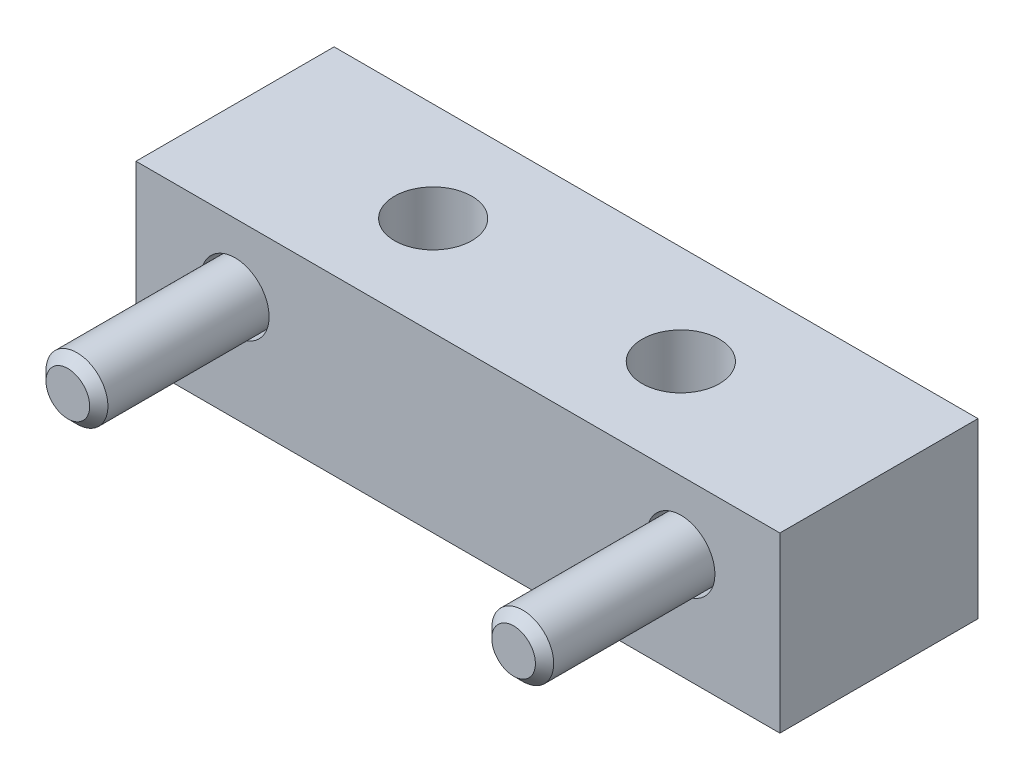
ISO-10303-21;
HEADER;
FILE_DESCRIPTION(('STEP AP214'),'2;1');
FILE_NAME('part.step','',(''),(''),'','','');
FILE_SCHEMA(('AUTOMOTIVE_DESIGN { 1 0 10303 214 1 1 1 1 }'));
ENDSEC;
DATA;
#1=APPLICATION_CONTEXT('core data for automotive mechanical design processes');
#2=APPLICATION_PROTOCOL_DEFINITION('international standard','automotive_design',2000,#1);
#3=PRODUCT_CONTEXT('',#1,'mechanical');
#4=PRODUCT('Part','Part','',(#3));
#5=PRODUCT_RELATED_PRODUCT_CATEGORY('part','',(#4));
#6=PRODUCT_DEFINITION_FORMATION('','',#4);
#7=PRODUCT_DEFINITION_CONTEXT('part definition',#1,'design');
#8=PRODUCT_DEFINITION('design','',#6,#7);
#9=PRODUCT_DEFINITION_SHAPE('','',#8);
#10=(LENGTH_UNIT() NAMED_UNIT(*) SI_UNIT(.MILLI.,.METRE.));
#11=(NAMED_UNIT(*) PLANE_ANGLE_UNIT() SI_UNIT($,.RADIAN.));
#12=(NAMED_UNIT(*) SI_UNIT($,.STERADIAN.) SOLID_ANGLE_UNIT());
#13=UNCERTAINTY_MEASURE_WITH_UNIT(LENGTH_MEASURE(1.E-05),#10,'distance_accuracy_value','');
#14=(GEOMETRIC_REPRESENTATION_CONTEXT(3) GLOBAL_UNCERTAINTY_ASSIGNED_CONTEXT((#13)) GLOBAL_UNIT_ASSIGNED_CONTEXT((#10,
#11,#12)) REPRESENTATION_CONTEXT('',''));
#15=CARTESIAN_POINT('',(0.,0.,0.));
#16=DIRECTION('',(0.,0.,1.));
#17=DIRECTION('',(1.,0.,0.));
#18=AXIS2_PLACEMENT_3D('',#15,#16,#17);
#19=CARTESIAN_POINT('',(34.074261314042,3.17499999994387,-20.7645));
#20=DIRECTION('',(0.,0.,1.));
#21=DIRECTION('',(0.5,0.866025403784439,0.));
#22=AXIS2_PLACEMENT_3D('',#19,#20,#21);
#23=PLANE('',#22);
#24=DIRECTION('',(-0.5,-0.866025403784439,0.));
#25=VECTOR('',#24,1.);
#26=CARTESIAN_POINT('',(32.2411742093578,-6.86032448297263E-11,-20.7645));
#27=LINE('',#26,#25);
#28=CARTESIAN_POINT('',(32.2411742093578,-6.86032448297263E-11,-20.7645));
#29=VERTEX_POINT('',#28);
#30=CARTESIAN_POINT('',(30.4080871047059,-3.17500000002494,-20.7645));
#31=VERTEX_POINT('',#30);
#32=EDGE_CURVE('E284',#29,#31,#27,.T.);
#33=ORIENTED_EDGE('',*,*,#32,.T.);
#34=DIRECTION('',(-1.,0.,0.));
#35=VECTOR('',#34,1.);
#36=CARTESIAN_POINT('',(30.4080871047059,-3.17500000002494,-20.7645));
#37=LINE('',#36,#35);
#38=CARTESIAN_POINT('',(26.7419128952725,-3.17500000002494,-20.7645));
#39=VERTEX_POINT('',#38);
#40=EDGE_CURVE('E287',#31,#39,#37,.T.);
#41=ORIENTED_EDGE('',*,*,#40,.T.);
#42=DIRECTION('',(-0.5,0.866025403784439,0.));
#43=VECTOR('',#42,1.);
#44=CARTESIAN_POINT('',(26.7419128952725,-3.17500000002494,-20.7645));
#45=LINE('',#44,#43);
#46=CARTESIAN_POINT('',(24.9088257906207,-6.86036785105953E-11,-20.7645));
#47=VERTEX_POINT('',#46);
#48=EDGE_CURVE('E290',#39,#47,#45,.T.);
#49=ORIENTED_EDGE('',*,*,#48,.T.);
#50=DIRECTION('',(0.5,0.866025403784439,0.));
#51=VECTOR('',#50,1.);
#52=CARTESIAN_POINT('',(24.9088257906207,-6.86036785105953E-11,-20.7645));
#53=LINE('',#52,#51);
#54=CARTESIAN_POINT('',(26.741912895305,3.17499999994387,-20.7645));
#55=VERTEX_POINT('',#54);
#56=EDGE_CURVE('E293',#47,#55,#53,.T.);
#57=ORIENTED_EDGE('',*,*,#56,.T.);
#58=DIRECTION('',(1.,0.,0.));
#59=VECTOR('',#58,1.);
#60=CARTESIAN_POINT('',(26.741912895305,3.17499999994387,-20.7645));
#61=LINE('',#60,#59);
#62=CARTESIAN_POINT('',(30.4080871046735,3.17499999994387,-20.7645));
#63=VERTEX_POINT('',#62);
#64=EDGE_CURVE('E296',#55,#63,#61,.T.);
#65=ORIENTED_EDGE('',*,*,#64,.T.);
#66=DIRECTION('',(0.5,-0.866025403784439,0.));
#67=VECTOR('',#66,1.);
#68=CARTESIAN_POINT('',(30.4080871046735,3.17499999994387,-20.7645));
#69=LINE('',#68,#67);
#70=EDGE_CURVE('E299',#63,#29,#69,.T.);
#71=ORIENTED_EDGE('',*,*,#70,.T.);
#72=EDGE_LOOP('',(#33,#41,#49,#57,#65,#71));
#73=FACE_BOUND('',#72,.T.);
#74=ADVANCED_FACE('F14',(#73),#23,.F.);
#75=CARTESIAN_POINT('',(30.4080871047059,-3.17500000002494,-20.7645));
#76=DIRECTION('',(0.,-1.,0.));
#77=DIRECTION('',(-1.,0.,0.));
#78=AXIS2_PLACEMENT_3D('',#75,#76,#77);
#79=PLANE('',#78);
#80=DIRECTION('',(-1.,0.,0.));
#81=VECTOR('',#80,1.);
#82=CARTESIAN_POINT('',(30.4080871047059,-3.17500000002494,-24.5999));
#83=LINE('',#82,#81);
#84=CARTESIAN_POINT('',(30.4080871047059,-3.17500000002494,-24.5999));
#85=VERTEX_POINT('',#84);
#86=CARTESIAN_POINT('',(26.7419128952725,-3.17500000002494,-24.5999));
#87=VERTEX_POINT('',#86);
#88=EDGE_CURVE('E270',#85,#87,#83,.T.);
#89=ORIENTED_EDGE('',*,*,#88,.T.);
#90=DIRECTION('',(0.,0.,-1.));
#91=VECTOR('',#90,1.);
#92=CARTESIAN_POINT('',(26.7419128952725,-3.17500000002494,-20.7645));
#93=LINE('',#92,#91);
#94=EDGE_CURVE('E311',#39,#87,#93,.T.);
#95=ORIENTED_EDGE('',*,*,#94,.F.);
#96=ORIENTED_EDGE('',*,*,#40,.F.);
#97=DIRECTION('',(0.,0.,-1.));
#98=VECTOR('',#97,1.);
#99=CARTESIAN_POINT('',(30.4080871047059,-3.17500000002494,-20.7645));
#100=LINE('',#99,#98);
#101=EDGE_CURVE('E302',#31,#85,#100,.T.);
#102=ORIENTED_EDGE('',*,*,#101,.T.);
#103=EDGE_LOOP('',(#89,#95,#96,#102));
#104=FACE_BOUND('',#103,.T.);
#105=ADVANCED_FACE('F525',(#104),#79,.F.);
#106=CARTESIAN_POINT('',(26.7419128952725,-3.17500000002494,-20.7645));
#107=DIRECTION('',(-0.866025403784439,-0.5,0.));
#108=DIRECTION('',(-0.5,0.866025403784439,0.));
#109=AXIS2_PLACEMENT_3D('',#106,#107,#108);
#110=PLANE('',#109);
#111=DIRECTION('',(-0.5,0.866025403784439,0.));
#112=VECTOR('',#111,1.);
#113=CARTESIAN_POINT('',(26.7419128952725,-3.17500000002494,-24.5999));
#114=LINE('',#113,#112);
#115=CARTESIAN_POINT('',(24.9088257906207,-6.86036785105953E-11,-24.5999));
#116=VERTEX_POINT('',#115);
#117=EDGE_CURVE('E273',#87,#116,#114,.T.);
#118=ORIENTED_EDGE('',*,*,#117,.T.);
#119=DIRECTION('',(0.,0.,-1.));
#120=VECTOR('',#119,1.);
#121=CARTESIAN_POINT('',(24.9088257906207,-6.86036785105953E-11,-20.7645));
#122=LINE('',#121,#120);
#123=EDGE_CURVE('E309',#47,#116,#122,.T.);
#124=ORIENTED_EDGE('',*,*,#123,.F.);
#125=ORIENTED_EDGE('',*,*,#48,.F.);
#126=ORIENTED_EDGE('',*,*,#94,.T.);
#127=EDGE_LOOP('',(#118,#124,#125,#126));
#128=FACE_BOUND('',#127,.T.);
#129=ADVANCED_FACE('F537',(#128),#110,.F.);
#130=CARTESIAN_POINT('',(24.9088257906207,-6.86036785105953E-11,-20.7645));
#131=DIRECTION('',(-0.866025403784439,0.5,0.));
#132=DIRECTION('',(0.5,0.866025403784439,0.));
#133=AXIS2_PLACEMENT_3D('',#130,#131,#132);
#134=PLANE('',#133);
#135=DIRECTION('',(0.5,0.866025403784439,0.));
#136=VECTOR('',#135,1.);
#137=CARTESIAN_POINT('',(24.9088257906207,-6.86036785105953E-11,-24.5999));
#138=LINE('',#137,#136);
#139=CARTESIAN_POINT('',(26.741912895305,3.17499999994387,-24.5999));
#140=VERTEX_POINT('',#139);
#141=EDGE_CURVE('E276',#116,#140,#138,.T.);
#142=ORIENTED_EDGE('',*,*,#141,.T.);
#143=DIRECTION('',(0.,0.,-1.));
#144=VECTOR('',#143,1.);
#145=CARTESIAN_POINT('',(26.741912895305,3.17499999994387,-20.7645));
#146=LINE('',#145,#144);
#147=EDGE_CURVE('E307',#55,#140,#146,.T.);
#148=ORIENTED_EDGE('',*,*,#147,.F.);
#149=ORIENTED_EDGE('',*,*,#56,.F.);
#150=ORIENTED_EDGE('',*,*,#123,.T.);
#151=EDGE_LOOP('',(#142,#148,#149,#150));
#152=FACE_BOUND('',#151,.T.);
#153=ADVANCED_FACE('F533',(#152),#134,.F.);
#154=CARTESIAN_POINT('',(26.741912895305,3.17499999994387,-20.7645));
#155=DIRECTION('',(0.,1.,0.));
#156=DIRECTION('',(1.,0.,0.));
#157=AXIS2_PLACEMENT_3D('',#154,#155,#156);
#158=PLANE('',#157);
#159=DIRECTION('',(1.,0.,0.));
#160=VECTOR('',#159,1.);
#161=CARTESIAN_POINT('',(26.741912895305,3.17499999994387,-24.5999));
#162=LINE('',#161,#160);
#163=CARTESIAN_POINT('',(30.4080871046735,3.17499999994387,-24.5999));
#164=VERTEX_POINT('',#163);
#165=EDGE_CURVE('E279',#140,#164,#162,.T.);
#166=ORIENTED_EDGE('',*,*,#165,.T.);
#167=DIRECTION('',(0.,0.,-1.));
#168=VECTOR('',#167,1.);
#169=CARTESIAN_POINT('',(30.4080871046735,3.17499999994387,-20.7645));
#170=LINE('',#169,#168);
#171=EDGE_CURVE('E305',#63,#164,#170,.T.);
#172=ORIENTED_EDGE('',*,*,#171,.F.);
#173=ORIENTED_EDGE('',*,*,#64,.F.);
#174=ORIENTED_EDGE('',*,*,#147,.T.);
#175=EDGE_LOOP('',(#166,#172,#173,#174));
#176=FACE_BOUND('',#175,.T.);
#177=ADVANCED_FACE('F530',(#176),#158,.F.);
#178=CARTESIAN_POINT('',(30.4080871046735,3.17499999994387,-20.7645));
#179=DIRECTION('',(0.866025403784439,0.5,0.));
#180=DIRECTION('',(0.5,-0.866025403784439,0.));
#181=AXIS2_PLACEMENT_3D('',#178,#179,#180);
#182=PLANE('',#181);
#183=DIRECTION('',(0.5,-0.866025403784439,0.));
#184=VECTOR('',#183,1.);
#185=CARTESIAN_POINT('',(30.4080871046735,3.17499999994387,-24.5999));
#186=LINE('',#185,#184);
#187=CARTESIAN_POINT('',(32.2411742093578,-6.86032448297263E-11,-24.5999));
#188=VERTEX_POINT('',#187);
#189=EDGE_CURVE('E282',#164,#188,#186,.T.);
#190=ORIENTED_EDGE('',*,*,#189,.T.);
#191=DIRECTION('',(0.,0.,-1.));
#192=VECTOR('',#191,1.);
#193=CARTESIAN_POINT('',(32.2411742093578,-6.86032448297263E-11,-20.7645));
#194=LINE('',#193,#192);
#195=EDGE_CURVE('E36',#29,#188,#194,.T.);
#196=ORIENTED_EDGE('',*,*,#195,.F.);
#197=ORIENTED_EDGE('',*,*,#70,.F.);
#198=ORIENTED_EDGE('',*,*,#171,.T.);
#199=EDGE_LOOP('',(#190,#196,#197,#198));
#200=FACE_BOUND('',#199,.T.);
#201=ADVANCED_FACE('F527',(#200),#182,.F.);
#202=CARTESIAN_POINT('',(32.2411742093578,-6.86032448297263E-11,-20.7645));
#203=DIRECTION('',(0.866025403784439,-0.5,0.));
#204=DIRECTION('',(-0.5,-0.866025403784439,0.));
#205=AXIS2_PLACEMENT_3D('',#202,#203,#204);
#206=PLANE('',#205);
#207=DIRECTION('',(-0.5,-0.866025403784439,0.));
#208=VECTOR('',#207,1.);
#209=CARTESIAN_POINT('',(32.2411742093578,-6.86032448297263E-11,-24.5999));
#210=LINE('',#209,#208);
#211=EDGE_CURVE('E29',#188,#85,#210,.T.);
#212=ORIENTED_EDGE('',*,*,#211,.T.);
#213=ORIENTED_EDGE('',*,*,#101,.F.);
#214=ORIENTED_EDGE('',*,*,#32,.F.);
#215=ORIENTED_EDGE('',*,*,#195,.T.);
#216=EDGE_LOOP('',(#212,#213,#214,#215));
#217=FACE_BOUND('',#216,.T.);
#218=ADVANCED_FACE('F459',(#217),#206,.F.);
#219=CARTESIAN_POINT('',(23.934503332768,2.679192,-24.5999));
#220=DIRECTION('',(0.,0.,-1.));
#221=DIRECTION('',(-0.5,-0.866025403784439,0.));
#222=AXIS2_PLACEMENT_3D('',#219,#220,#221);
#223=PLANE('',#222);
#224=ORIENTED_EDGE('',*,*,#211,.F.);
#225=ORIENTED_EDGE('',*,*,#189,.F.);
#226=ORIENTED_EDGE('',*,*,#165,.F.);
#227=ORIENTED_EDGE('',*,*,#141,.F.);
#228=ORIENTED_EDGE('',*,*,#117,.F.);
#229=ORIENTED_EDGE('',*,*,#88,.F.);
#230=EDGE_LOOP('',(#224,#225,#226,#227,#228,#229));
#231=FACE_BOUND('',#230,.T.);
#232=CARTESIAN_POINT('',(28.575,0.,-24.5999));
#233=DIRECTION('',(0.,0.,1.));
#234=DIRECTION('',(0.5,0.866025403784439,0.));
#235=AXIS2_PLACEMENT_3D('',#232,#233,#234);
#236=CIRCLE('',#235,5.358384);
#237=CARTESIAN_POINT('',(31.254192,4.64049666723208,-24.5999));
#238=VERTEX_POINT('',#237);
#239=EDGE_CURVE('E319',#238,#238,#236,.T.);
#240=ORIENTED_EDGE('',*,*,#239,.F.);
#241=EDGE_LOOP('',(#240));
#242=FACE_BOUND('',#241,.T.);
#243=ADVANCED_FACE('F465',(#231,#242),#223,.T.);
#244=CARTESIAN_POINT('',(28.575,0.,-24.004524));
#245=DIRECTION('',(0.,0.,1.));
#246=DIRECTION('',(0.5,0.866025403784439,0.));
#247=AXIS2_PLACEMENT_3D('',#244,#245,#246);
#248=CONICAL_SURFACE('',#247,5.95376,0.785398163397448);
#249=ORIENTED_EDGE('',*,*,#239,.T.);
#250=EDGE_LOOP('',(#249));
#251=FACE_BOUND('',#250,.T.);
#252=CARTESIAN_POINT('',(28.575,0.,-24.004524));
#253=DIRECTION('',(0.,0.,1.));
#254=DIRECTION('',(0.5,0.866025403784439,0.));
#255=AXIS2_PLACEMENT_3D('',#252,#253,#254);
#256=CIRCLE('',#255,5.95376);
#257=CARTESIAN_POINT('',(31.55188,5.15610740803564,-24.004524));
#258=VERTEX_POINT('',#257);
#259=EDGE_CURVE('E322',#258,#258,#256,.T.);
#260=ORIENTED_EDGE('',*,*,#259,.F.);
#261=EDGE_LOOP('',(#260));
#262=FACE_BOUND('',#261,.T.);
#263=ADVANCED_FACE('F468',(#251,#262),#248,.T.);
#264=CARTESIAN_POINT('',(28.575,0.,-16.6624));
#265=DIRECTION('',(0.,0.,1.));
#266=DIRECTION('',(0.5,0.866025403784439,0.));
#267=AXIS2_PLACEMENT_3D('',#264,#265,#266);
#268=CYLINDRICAL_SURFACE('',#267,5.95376);
#269=ORIENTED_EDGE('',*,*,#259,.T.);
#270=EDGE_LOOP('',(#269));
#271=FACE_BOUND('',#270,.T.);
#272=CARTESIAN_POINT('',(28.575,0.,-16.6624));
#273=DIRECTION('',(0.,0.,1.));
#274=DIRECTION('',(0.5,0.866025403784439,0.));
#275=AXIS2_PLACEMENT_3D('',#272,#273,#274);
#276=CIRCLE('',#275,5.95376);
#277=CARTESIAN_POINT('',(31.55188,5.15610740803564,-16.6624));
#278=VERTEX_POINT('',#277);
#279=EDGE_CURVE('E325',#278,#278,#276,.T.);
#280=ORIENTED_EDGE('',*,*,#279,.F.);
#281=EDGE_LOOP('',(#280));
#282=FACE_BOUND('',#281,.T.);
#283=ADVANCED_FACE('F336',(#271,#282),#268,.T.);
#284=CARTESIAN_POINT('',(28.575,0.,-16.6624));
#285=DIRECTION('',(0.,0.,1.));
#286=DIRECTION('',(0.5,0.866025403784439,0.));
#287=AXIS2_PLACEMENT_3D('',#284,#285,#286);
#288=PLANE('',#287);
#289=CARTESIAN_POINT('',(28.575,0.,-16.6624));
#290=DIRECTION('',(0.,0.,1.));
#291=DIRECTION('',(0.5,0.866025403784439,0.));
#292=AXIS2_PLACEMENT_3D('',#289,#290,#291);
#293=CIRCLE('',#292,3.96875);
#294=CARTESIAN_POINT('',(30.559375,3.43703832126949,-16.6624));
#295=VERTEX_POINT('',#294);
#296=EDGE_CURVE('E22',#295,#295,#293,.T.);
#297=ORIENTED_EDGE('',*,*,#296,.F.);
#298=EDGE_LOOP('',(#297));
#299=FACE_BOUND('',#298,.T.);
#300=CARTESIAN_POINT('',(28.575,0.,-16.6624));
#301=DIRECTION('',(0.,0.,1.));
#302=DIRECTION('',(1.,0.,0.));
#303=AXIS2_PLACEMENT_3D('',#300,#301,#302);
#304=CIRCLE('',#303,4.3688);
#305=CARTESIAN_POINT('',(32.9438,0.,-16.6624));
#306=VERTEX_POINT('',#305);
#307=EDGE_CURVE('E9',#306,#306,#304,.T.);
#308=ORIENTED_EDGE('',*,*,#307,.T.);
#309=EDGE_LOOP('',(#308));
#310=FACE_BOUND('',#309,.T.);
#311=ADVANCED_FACE('F16',(#299,#310),#288,.T.);
#312=CARTESIAN_POINT('',(28.575,0.,21.4376));
#313=DIRECTION('',(0.,0.,1.));
#314=DIRECTION('',(0.5,0.866025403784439,0.));
#315=AXIS2_PLACEMENT_3D('',#312,#313,#314);
#316=PLANE('',#315);
#317=CARTESIAN_POINT('',(28.575,0.,21.4376));
#318=DIRECTION('',(0.,0.,1.));
#319=DIRECTION('',(0.5,0.866025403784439,0.));
#320=AXIS2_PLACEMENT_3D('',#317,#318,#319);
#321=CIRCLE('',#320,2.79768935);
#322=CARTESIAN_POINT('',(29.973844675,2.42287004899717,21.4376));
#323=VERTEX_POINT('',#322);
#324=EDGE_CURVE('E316',#323,#323,#321,.T.);
#325=ORIENTED_EDGE('',*,*,#324,.T.);
#326=EDGE_LOOP('',(#325));
#327=FACE_BOUND('',#326,.T.);
#328=ADVANCED_FACE('F335',(#327),#316,.T.);
#329=CARTESIAN_POINT('',(28.575,0.,21.4376));
#330=DIRECTION('',(0.,0.,-1.));
#331=DIRECTION('',(-0.5,-0.866025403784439,0.));
#332=AXIS2_PLACEMENT_3D('',#329,#330,#331);
#333=CONICAL_SURFACE('',#332,2.79768935,0.785398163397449);
#334=CARTESIAN_POINT('',(28.575,0.,20.26653935));
#335=DIRECTION('',(0.,0.,1.));
#336=DIRECTION('',(0.5,0.866025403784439,0.));
#337=AXIS2_PLACEMENT_3D('',#334,#335,#336);
#338=CIRCLE('',#337,3.96875);
#339=CARTESIAN_POINT('',(30.559375,3.43703832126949,20.26653935));
#340=VERTEX_POINT('',#339);
#341=EDGE_CURVE('E304',#340,#340,#338,.T.);
#342=ORIENTED_EDGE('',*,*,#341,.T.);
#343=EDGE_LOOP('',(#342));
#344=FACE_BOUND('',#343,.T.);
#345=ORIENTED_EDGE('',*,*,#324,.F.);
#346=EDGE_LOOP('',(#345));
#347=FACE_BOUND('',#346,.T.);
#348=ADVANCED_FACE('F446',(#344,#347),#333,.T.);
#349=CARTESIAN_POINT('',(28.575,0.,-16.6624));
#350=DIRECTION('',(0.,0.,1.));
#351=DIRECTION('',(0.5,0.866025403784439,0.));
#352=AXIS2_PLACEMENT_3D('',#349,#350,#351);
#353=CYLINDRICAL_SURFACE('',#352,3.96875);
#354=ORIENTED_EDGE('',*,*,#296,.T.);
#355=EDGE_LOOP('',(#354));
#356=FACE_BOUND('',#355,.T.);
#357=ORIENTED_EDGE('',*,*,#341,.F.);
#358=EDGE_LOOP('',(#357));
#359=FACE_BOUND('',#358,.T.);
#360=ADVANCED_FACE('F330',(#356,#359),#353,.T.);
#361=CARTESIAN_POINT('',(-23.075738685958,3.17499999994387,-20.7645));
#362=DIRECTION('',(0.,0.,1.));
#363=DIRECTION('',(0.5,0.866025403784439,0.));
#364=AXIS2_PLACEMENT_3D('',#361,#362,#363);
#365=PLANE('',#364);
#366=DIRECTION('',(-0.5,-0.866025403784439,0.));
#367=VECTOR('',#366,1.);
#368=CARTESIAN_POINT('',(-24.9088257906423,-6.86032448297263E-11,-20.7645));
#369=LINE('',#368,#367);
#370=CARTESIAN_POINT('',(-24.9088257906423,-6.86032448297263E-11,-20.7645));
#371=VERTEX_POINT('',#370);
#372=CARTESIAN_POINT('',(-26.7419128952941,-3.17500000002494,-20.7645));
#373=VERTEX_POINT('',#372);
#374=EDGE_CURVE('E165',#371,#373,#369,.T.);
#375=ORIENTED_EDGE('',*,*,#374,.T.);
#376=DIRECTION('',(-1.,0.,0.));
#377=VECTOR('',#376,1.);
#378=CARTESIAN_POINT('',(-26.7419128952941,-3.17500000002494,-20.7645));
#379=LINE('',#378,#377);
#380=CARTESIAN_POINT('',(-30.4080871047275,-3.17500000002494,-20.7645));
#381=VERTEX_POINT('',#380);
#382=EDGE_CURVE('E168',#373,#381,#379,.T.);
#383=ORIENTED_EDGE('',*,*,#382,.T.);
#384=DIRECTION('',(-0.5,0.866025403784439,0.));
#385=VECTOR('',#384,1.);
#386=CARTESIAN_POINT('',(-30.4080871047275,-3.17500000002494,-20.7645));
#387=LINE('',#386,#385);
#388=CARTESIAN_POINT('',(-32.2411742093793,-6.86036785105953E-11,-20.7645));
#389=VERTEX_POINT('',#388);
#390=EDGE_CURVE('E135',#381,#389,#387,.T.);
#391=ORIENTED_EDGE('',*,*,#390,.T.);
#392=DIRECTION('',(0.5,0.866025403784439,0.));
#393=VECTOR('',#392,1.);
#394=CARTESIAN_POINT('',(-32.2411742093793,-6.86036785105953E-11,-20.7645));
#395=LINE('',#394,#393);
#396=CARTESIAN_POINT('',(-30.4080871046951,3.17499999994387,-20.7645));
#397=VERTEX_POINT('',#396);
#398=EDGE_CURVE('E171',#389,#397,#395,.T.);
#399=ORIENTED_EDGE('',*,*,#398,.T.);
#400=DIRECTION('',(1.,0.,0.));
#401=VECTOR('',#400,1.);
#402=CARTESIAN_POINT('',(-30.4080871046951,3.17499999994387,-20.7645));
#403=LINE('',#402,#401);
#404=CARTESIAN_POINT('',(-26.7419128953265,3.17499999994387,-20.7645));
#405=VERTEX_POINT('',#404);
#406=EDGE_CURVE('E174',#397,#405,#403,.T.);
#407=ORIENTED_EDGE('',*,*,#406,.T.);
#408=DIRECTION('',(0.5,-0.866025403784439,0.));
#409=VECTOR('',#408,1.);
#410=CARTESIAN_POINT('',(-26.7419128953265,3.17499999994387,-20.7645));
#411=LINE('',#410,#409);
#412=EDGE_CURVE('E177',#405,#371,#411,.T.);
#413=ORIENTED_EDGE('',*,*,#412,.T.);
#414=EDGE_LOOP('',(#375,#383,#391,#399,#407,#413));
#415=FACE_BOUND('',#414,.T.);
#416=ADVANCED_FACE('F402',(#415),#365,.F.);
#417=CARTESIAN_POINT('',(-26.7419128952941,-3.17500000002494,-20.7645));
#418=DIRECTION('',(0.,-1.,0.));
#419=DIRECTION('',(-1.,0.,0.));
#420=AXIS2_PLACEMENT_3D('',#417,#418,#419);
#421=PLANE('',#420);
#422=DIRECTION('',(-1.,0.,0.));
#423=VECTOR('',#422,1.);
#424=CARTESIAN_POINT('',(-26.7419128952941,-3.17500000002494,-24.5999));
#425=LINE('',#424,#423);
#426=CARTESIAN_POINT('',(-26.7419128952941,-3.17500000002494,-24.5999));
#427=VERTEX_POINT('',#426);
#428=CARTESIAN_POINT('',(-30.4080871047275,-3.17500000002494,-24.5999));
#429=VERTEX_POINT('',#428);
#430=EDGE_CURVE('E144',#427,#429,#425,.T.);
#431=ORIENTED_EDGE('',*,*,#430,.T.);
#432=DIRECTION('',(0.,0.,-1.));
#433=VECTOR('',#432,1.);
#434=CARTESIAN_POINT('',(-30.4080871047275,-3.17500000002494,-20.7645));
#435=LINE('',#434,#433);
#436=EDGE_CURVE('E128',#381,#429,#435,.T.);
#437=ORIENTED_EDGE('',*,*,#436,.F.);
#438=ORIENTED_EDGE('',*,*,#382,.F.);
#439=DIRECTION('',(0.,0.,-1.));
#440=VECTOR('',#439,1.);
#441=CARTESIAN_POINT('',(-26.7419128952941,-3.17500000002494,-20.7645));
#442=LINE('',#441,#440);
#443=EDGE_CURVE('E140',#373,#427,#442,.T.);
#444=ORIENTED_EDGE('',*,*,#443,.T.);
#445=EDGE_LOOP('',(#431,#437,#438,#444));
#446=FACE_BOUND('',#445,.T.);
#447=ADVANCED_FACE('F145',(#446),#421,.F.);
#448=CARTESIAN_POINT('',(-30.4080871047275,-3.17500000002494,-20.7645));
#449=DIRECTION('',(-0.866025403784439,-0.5,0.));
#450=DIRECTION('',(-0.5,0.866025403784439,0.));
#451=AXIS2_PLACEMENT_3D('',#448,#449,#450);
#452=PLANE('',#451);
#453=DIRECTION('',(-0.5,0.866025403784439,0.));
#454=VECTOR('',#453,1.);
#455=CARTESIAN_POINT('',(-30.4080871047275,-3.17500000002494,-24.5999));
#456=LINE('',#455,#454);
#457=CARTESIAN_POINT('',(-32.2411742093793,-6.86036785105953E-11,-24.5999));
#458=VERTEX_POINT('',#457);
#459=EDGE_CURVE('E132',#429,#458,#456,.T.);
#460=ORIENTED_EDGE('',*,*,#459,.T.);
#461=DIRECTION('',(0.,0.,-1.));
#462=VECTOR('',#461,1.);
#463=CARTESIAN_POINT('',(-32.2411742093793,-6.86036785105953E-11,-20.7645));
#464=LINE('',#463,#462);
#465=EDGE_CURVE('E139',#389,#458,#464,.T.);
#466=ORIENTED_EDGE('',*,*,#465,.F.);
#467=ORIENTED_EDGE('',*,*,#390,.F.);
#468=ORIENTED_EDGE('',*,*,#436,.T.);
#469=EDGE_LOOP('',(#460,#466,#467,#468));
#470=FACE_BOUND('',#469,.T.);
#471=ADVANCED_FACE('F130',(#470),#452,.F.);
#472=CARTESIAN_POINT('',(-32.2411742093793,-6.86036785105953E-11,-20.7645));
#473=DIRECTION('',(-0.866025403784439,0.5,0.));
#474=DIRECTION('',(0.5,0.866025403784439,0.));
#475=AXIS2_PLACEMENT_3D('',#472,#473,#474);
#476=PLANE('',#475);
#477=DIRECTION('',(0.5,0.866025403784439,0.));
#478=VECTOR('',#477,1.);
#479=CARTESIAN_POINT('',(-32.2411742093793,-6.86036785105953E-11,-24.5999));
#480=LINE('',#479,#478);
#481=CARTESIAN_POINT('',(-30.4080871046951,3.17499999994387,-24.5999));
#482=VERTEX_POINT('',#481);
#483=EDGE_CURVE('E154',#458,#482,#480,.T.);
#484=ORIENTED_EDGE('',*,*,#483,.T.);
#485=DIRECTION('',(0.,0.,-1.));
#486=VECTOR('',#485,1.);
#487=CARTESIAN_POINT('',(-30.4080871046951,3.17499999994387,-20.7645));
#488=LINE('',#487,#486);
#489=EDGE_CURVE('E185',#397,#482,#488,.T.);
#490=ORIENTED_EDGE('',*,*,#489,.F.);
#491=ORIENTED_EDGE('',*,*,#398,.F.);
#492=ORIENTED_EDGE('',*,*,#465,.T.);
#493=EDGE_LOOP('',(#484,#490,#491,#492));
#494=FACE_BOUND('',#493,.T.);
#495=ADVANCED_FACE('F430',(#494),#476,.F.);
#496=CARTESIAN_POINT('',(-30.4080871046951,3.17499999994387,-20.7645));
#497=DIRECTION('',(0.,1.,0.));
#498=DIRECTION('',(1.,0.,0.));
#499=AXIS2_PLACEMENT_3D('',#496,#497,#498);
#500=PLANE('',#499);
#501=DIRECTION('',(1.,0.,0.));
#502=VECTOR('',#501,1.);
#503=CARTESIAN_POINT('',(-30.4080871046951,3.17499999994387,-24.5999));
#504=LINE('',#503,#502);
#505=CARTESIAN_POINT('',(-26.7419128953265,3.17499999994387,-24.5999));
#506=VERTEX_POINT('',#505);
#507=EDGE_CURVE('E156',#482,#506,#504,.T.);
#508=ORIENTED_EDGE('',*,*,#507,.T.);
#509=DIRECTION('',(0.,0.,-1.));
#510=VECTOR('',#509,1.);
#511=CARTESIAN_POINT('',(-26.7419128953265,3.17499999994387,-20.7645));
#512=LINE('',#511,#510);
#513=EDGE_CURVE('E183',#405,#506,#512,.T.);
#514=ORIENTED_EDGE('',*,*,#513,.F.);
#515=ORIENTED_EDGE('',*,*,#406,.F.);
#516=ORIENTED_EDGE('',*,*,#489,.T.);
#517=EDGE_LOOP('',(#508,#514,#515,#516));
#518=FACE_BOUND('',#517,.T.);
#519=ADVANCED_FACE('F433',(#518),#500,.F.);
#520=CARTESIAN_POINT('',(-26.7419128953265,3.17499999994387,-20.7645));
#521=DIRECTION('',(0.866025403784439,0.5,0.));
#522=DIRECTION('',(0.5,-0.866025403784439,0.));
#523=AXIS2_PLACEMENT_3D('',#520,#521,#522);
#524=PLANE('',#523);
#525=DIRECTION('',(0.5,-0.866025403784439,0.));
#526=VECTOR('',#525,1.);
#527=CARTESIAN_POINT('',(-26.7419128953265,3.17499999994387,-24.5999));
#528=LINE('',#527,#526);
#529=CARTESIAN_POINT('',(-24.9088257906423,-6.86032448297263E-11,-24.5999));
#530=VERTEX_POINT('',#529);
#531=EDGE_CURVE('E162',#506,#530,#528,.T.);
#532=ORIENTED_EDGE('',*,*,#531,.T.);
#533=DIRECTION('',(0.,0.,-1.));
#534=VECTOR('',#533,1.);
#535=CARTESIAN_POINT('',(-24.9088257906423,-6.86032448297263E-11,-20.7645));
#536=LINE('',#535,#534);
#537=EDGE_CURVE('E180',#371,#530,#536,.T.);
#538=ORIENTED_EDGE('',*,*,#537,.F.);
#539=ORIENTED_EDGE('',*,*,#412,.F.);
#540=ORIENTED_EDGE('',*,*,#513,.T.);
#541=EDGE_LOOP('',(#532,#538,#539,#540));
#542=FACE_BOUND('',#541,.T.);
#543=ADVANCED_FACE('F422',(#542),#524,.F.);
#544=CARTESIAN_POINT('',(-24.9088257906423,-6.86032448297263E-11,-20.7645));
#545=DIRECTION('',(0.866025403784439,-0.5,0.));
#546=DIRECTION('',(-0.5,-0.866025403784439,0.));
#547=AXIS2_PLACEMENT_3D('',#544,#545,#546);
#548=PLANE('',#547);
#549=DIRECTION('',(-0.5,-0.866025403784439,0.));
#550=VECTOR('',#549,1.);
#551=CARTESIAN_POINT('',(-24.9088257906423,-6.86032448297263E-11,-24.5999));
#552=LINE('',#551,#550);
#553=EDGE_CURVE('E148',#530,#427,#552,.T.);
#554=ORIENTED_EDGE('',*,*,#553,.T.);
#555=ORIENTED_EDGE('',*,*,#443,.F.);
#556=ORIENTED_EDGE('',*,*,#374,.F.);
#557=ORIENTED_EDGE('',*,*,#537,.T.);
#558=EDGE_LOOP('',(#554,#555,#556,#557));
#559=FACE_BOUND('',#558,.T.);
#560=ADVANCED_FACE('F418',(#559),#548,.F.);
#561=CARTESIAN_POINT('',(-33.2154966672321,2.679192,-24.5999));
#562=DIRECTION('',(0.,0.,-1.));
#563=DIRECTION('',(-0.5,-0.866025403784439,0.));
#564=AXIS2_PLACEMENT_3D('',#561,#562,#563);
#565=PLANE('',#564);
#566=ORIENTED_EDGE('',*,*,#553,.F.);
#567=ORIENTED_EDGE('',*,*,#531,.F.);
#568=ORIENTED_EDGE('',*,*,#507,.F.);
#569=ORIENTED_EDGE('',*,*,#483,.F.);
#570=ORIENTED_EDGE('',*,*,#459,.F.);
#571=ORIENTED_EDGE('',*,*,#430,.F.);
#572=EDGE_LOOP('',(#566,#567,#568,#569,#570,#571));
#573=FACE_BOUND('',#572,.T.);
#574=CARTESIAN_POINT('',(-28.575,0.,-24.5999));
#575=DIRECTION('',(0.,0.,1.));
#576=DIRECTION('',(0.5,0.866025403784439,0.));
#577=AXIS2_PLACEMENT_3D('',#574,#575,#576);
#578=CIRCLE('',#577,5.358384);
#579=CARTESIAN_POINT('',(-25.895808,4.64049666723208,-24.5999));
#580=VERTEX_POINT('',#579);
#581=EDGE_CURVE('E194',#580,#580,#578,.T.);
#582=ORIENTED_EDGE('',*,*,#581,.F.);
#583=EDGE_LOOP('',(#582));
#584=FACE_BOUND('',#583,.T.);
#585=ADVANCED_FACE('F150',(#573,#584),#565,.T.);
#586=CARTESIAN_POINT('',(-28.575,0.,21.4376));
#587=DIRECTION('',(0.,0.,1.));
#588=DIRECTION('',(0.5,0.866025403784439,0.));
#589=AXIS2_PLACEMENT_3D('',#586,#587,#588);
#590=PLANE('',#589);
#591=CARTESIAN_POINT('',(-28.575,0.,21.4376));
#592=DIRECTION('',(0.,0.,1.));
#593=DIRECTION('',(0.5,0.866025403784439,0.));
#594=AXIS2_PLACEMENT_3D('',#591,#592,#593);
#595=CIRCLE('',#594,2.79768935);
#596=CARTESIAN_POINT('',(-27.176155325,2.42287004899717,21.4376));
#597=VERTEX_POINT('',#596);
#598=EDGE_CURVE('E191',#597,#597,#595,.T.);
#599=ORIENTED_EDGE('',*,*,#598,.T.);
#600=EDGE_LOOP('',(#599));
#601=FACE_BOUND('',#600,.T.);
#602=ADVANCED_FACE('F405',(#601),#590,.T.);
#603=CARTESIAN_POINT('',(-28.575,0.,-24.004524));
#604=DIRECTION('',(0.,0.,1.));
#605=DIRECTION('',(0.5,0.866025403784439,0.));
#606=AXIS2_PLACEMENT_3D('',#603,#604,#605);
#607=CONICAL_SURFACE('',#606,5.95376,0.785398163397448);
#608=ORIENTED_EDGE('',*,*,#581,.T.);
#609=EDGE_LOOP('',(#608));
#610=FACE_BOUND('',#609,.T.);
#611=CARTESIAN_POINT('',(-28.575,0.,-24.004524));
#612=DIRECTION('',(0.,0.,1.));
#613=DIRECTION('',(0.5,0.866025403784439,0.));
#614=AXIS2_PLACEMENT_3D('',#611,#612,#613);
#615=CIRCLE('',#614,5.95376);
#616=CARTESIAN_POINT('',(-25.59812,5.15610740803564,-24.004524));
#617=VERTEX_POINT('',#616);
#618=EDGE_CURVE('E197',#617,#617,#615,.T.);
#619=ORIENTED_EDGE('',*,*,#618,.F.);
#620=EDGE_LOOP('',(#619));
#621=FACE_BOUND('',#620,.T.);
#622=ADVANCED_FACE('F395',(#610,#621),#607,.T.);
#623=CARTESIAN_POINT('',(-28.575,0.,21.4376));
#624=DIRECTION('',(0.,0.,-1.));
#625=DIRECTION('',(-0.5,-0.866025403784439,0.));
#626=AXIS2_PLACEMENT_3D('',#623,#624,#625);
#627=CONICAL_SURFACE('',#626,2.79768935,0.785398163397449);
#628=CARTESIAN_POINT('',(-28.575,0.,20.26653935));
#629=DIRECTION('',(0.,0.,1.));
#630=DIRECTION('',(0.5,0.866025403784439,0.));
#631=AXIS2_PLACEMENT_3D('',#628,#629,#630);
#632=CIRCLE('',#631,3.96875);
#633=CARTESIAN_POINT('',(-26.590625,3.43703832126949,20.26653935));
#634=VERTEX_POINT('',#633);
#635=EDGE_CURVE('E182',#634,#634,#632,.T.);
#636=ORIENTED_EDGE('',*,*,#635,.T.);
#637=EDGE_LOOP('',(#636));
#638=FACE_BOUND('',#637,.T.);
#639=ORIENTED_EDGE('',*,*,#598,.F.);
#640=EDGE_LOOP('',(#639));
#641=FACE_BOUND('',#640,.T.);
#642=ADVANCED_FACE('F392',(#638,#641),#627,.T.);
#643=CARTESIAN_POINT('',(-28.575,0.,-16.6624));
#644=DIRECTION('',(0.,0.,1.));
#645=DIRECTION('',(0.5,0.866025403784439,0.));
#646=AXIS2_PLACEMENT_3D('',#643,#644,#645);
#647=CYLINDRICAL_SURFACE('',#646,5.95376);
#648=ORIENTED_EDGE('',*,*,#618,.T.);
#649=EDGE_LOOP('',(#648));
#650=FACE_BOUND('',#649,.T.);
#651=CARTESIAN_POINT('',(-28.575,0.,-16.662407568));
#652=DIRECTION('',(0.,0.,1.));
#653=DIRECTION('',(1.,0.,0.));
#654=AXIS2_PLACEMENT_3D('',#651,#652,#653);
#655=CIRCLE('',#654,5.95376);
#656=CARTESIAN_POINT('',(-22.62124,0.,-16.662407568));
#657=VERTEX_POINT('',#656);
#658=EDGE_CURVE('E266',#657,#657,#655,.T.);
#659=ORIENTED_EDGE('',*,*,#658,.F.);
#660=EDGE_LOOP('',(#659));
#661=FACE_BOUND('',#660,.T.);
#662=ADVANCED_FACE('F386',(#650,#661),#647,.T.);
#663=CARTESIAN_POINT('',(-28.575,0.,-16.6624));
#664=DIRECTION('',(0.,0.,1.));
#665=DIRECTION('',(0.5,0.866025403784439,0.));
#666=AXIS2_PLACEMENT_3D('',#663,#664,#665);
#667=CYLINDRICAL_SURFACE('',#666,3.96875);
#668=CARTESIAN_POINT('',(-28.575,0.,-16.6624));
#669=DIRECTION('',(0.,0.,1.));
#670=DIRECTION('',(0.5,0.866025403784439,0.));
#671=AXIS2_PLACEMENT_3D('',#668,#669,#670);
#672=CIRCLE('',#671,3.96875);
#673=CARTESIAN_POINT('',(-26.590625,3.43703832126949,-16.6624));
#674=VERTEX_POINT('',#673);
#675=EDGE_CURVE('E200',#674,#674,#672,.T.);
#676=ORIENTED_EDGE('',*,*,#675,.T.);
#677=EDGE_LOOP('',(#676));
#678=FACE_BOUND('',#677,.T.);
#679=ORIENTED_EDGE('',*,*,#635,.F.);
#680=EDGE_LOOP('',(#679));
#681=FACE_BOUND('',#680,.T.);
#682=ADVANCED_FACE('F372',(#678,#681),#667,.T.);
#683=CARTESIAN_POINT('',(-32.943796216,0.,-16.662407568));
#684=DIRECTION('',(0.,0.,1.));
#685=DIRECTION('',(1.,0.,0.));
#686=AXIS2_PLACEMENT_3D('',#683,#684,#685);
#687=PLANE('',#686);
#688=ORIENTED_EDGE('',*,*,#658,.T.);
#689=EDGE_LOOP('',(#688));
#690=FACE_BOUND('',#689,.T.);
#691=CARTESIAN_POINT('',(-28.575,0.,-16.662407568));
#692=DIRECTION('',(0.,0.,-1.));
#693=DIRECTION('',(-1.,0.,0.));
#694=AXIS2_PLACEMENT_3D('',#691,#692,#693);
#695=CIRCLE('',#694,7.14374381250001);
#696=CARTESIAN_POINT('',(-35.7187438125,0.,-16.662407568));
#697=VERTEX_POINT('',#696);
#698=EDGE_CURVE('E218',#697,#697,#695,.T.);
#699=ORIENTED_EDGE('',*,*,#698,.T.);
#700=EDGE_LOOP('',(#699));
#701=FACE_BOUND('',#700,.T.);
#702=ADVANCED_FACE('F359',(#690,#701),#687,.F.);
#703=CARTESIAN_POINT('',(15.875,-13.4874,-12.7));
#704=DIRECTION('',(0.,1.,0.));
#705=DIRECTION('',(0.,0.,-1.));
#706=AXIS2_PLACEMENT_3D('',#703,#704,#705);
#707=CYLINDRICAL_SURFACE('',#706,4.953);
#708=CARTESIAN_POINT('',(15.875,-13.4874,-12.7));
#709=DIRECTION('',(0.,1.,0.));
#710=DIRECTION('',(0.,0.,-1.));
#711=AXIS2_PLACEMENT_3D('',#708,#709,#710);
#712=CIRCLE('',#711,4.953);
#713=CARTESIAN_POINT('',(15.875,-13.4874,-17.653));
#714=VERTEX_POINT('',#713);
#715=EDGE_CURVE('E212',#714,#714,#712,.T.);
#716=ORIENTED_EDGE('',*,*,#715,.F.);
#717=EDGE_LOOP('',(#716));
#718=FACE_BOUND('',#717,.T.);
#719=CARTESIAN_POINT('',(15.875,8.7376,-12.7));
#720=DIRECTION('',(0.,1.,0.));
#721=DIRECTION('',(0.,0.,-1.));
#722=AXIS2_PLACEMENT_3D('',#719,#720,#721);
#723=CIRCLE('',#722,4.953);
#724=CARTESIAN_POINT('',(15.875,8.7376,-17.653));
#725=VERTEX_POINT('',#724);
#726=EDGE_CURVE('E209',#725,#725,#723,.T.);
#727=ORIENTED_EDGE('',*,*,#726,.T.);
#728=EDGE_LOOP('',(#727));
#729=FACE_BOUND('',#728,.T.);
#730=ADVANCED_FACE('F360',(#718,#729),#707,.F.);
#731=CARTESIAN_POINT('',(-15.875,-13.4874,-12.7));
#732=DIRECTION('',(0.,1.,0.));
#733=DIRECTION('',(0.,0.,-1.));
#734=AXIS2_PLACEMENT_3D('',#731,#732,#733);
#735=CYLINDRICAL_SURFACE('',#734,4.953);
#736=CARTESIAN_POINT('',(-15.875,-13.4874,-12.7));
#737=DIRECTION('',(0.,1.,0.));
#738=DIRECTION('',(0.,0.,-1.));
#739=AXIS2_PLACEMENT_3D('',#736,#737,#738);
#740=CIRCLE('',#739,4.953);
#741=CARTESIAN_POINT('',(-15.875,-13.4874,-17.653));
#742=VERTEX_POINT('',#741);
#743=EDGE_CURVE('E206',#742,#742,#740,.T.);
#744=ORIENTED_EDGE('',*,*,#743,.F.);
#745=EDGE_LOOP('',(#744));
#746=FACE_BOUND('',#745,.T.);
#747=CARTESIAN_POINT('',(-15.875,8.7376,-12.7));
#748=DIRECTION('',(0.,1.,0.));
#749=DIRECTION('',(0.,0.,-1.));
#750=AXIS2_PLACEMENT_3D('',#747,#748,#749);
#751=CIRCLE('',#750,4.953);
#752=CARTESIAN_POINT('',(-15.875,8.7376,-17.653));
#753=VERTEX_POINT('',#752);
#754=EDGE_CURVE('E203',#753,#753,#751,.T.);
#755=ORIENTED_EDGE('',*,*,#754,.T.);
#756=EDGE_LOOP('',(#755));
#757=FACE_BOUND('',#756,.T.);
#758=ADVANCED_FACE('F362',(#746,#757),#735,.F.);
#759=CARTESIAN_POINT('',(-28.575,0.,-16.6624));
#760=DIRECTION('',(0.,0.,1.));
#761=DIRECTION('',(0.5,0.866025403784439,0.));
#762=AXIS2_PLACEMENT_3D('',#759,#760,#761);
#763=PLANE('',#762);
#764=ORIENTED_EDGE('',*,*,#675,.F.);
#765=EDGE_LOOP('',(#764));
#766=FACE_BOUND('',#765,.T.);
#767=CARTESIAN_POINT('',(-28.575,0.,-16.662407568));
#768=DIRECTION('',(0.,0.,-1.));
#769=DIRECTION('',(-1.,0.,0.));
#770=AXIS2_PLACEMENT_3D('',#767,#768,#769);
#771=CIRCLE('',#770,4.36879621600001);
#772=CARTESIAN_POINT('',(-32.943796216,0.,-16.662407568));
#773=VERTEX_POINT('',#772);
#774=EDGE_CURVE('E221',#773,#773,#771,.T.);
#775=ORIENTED_EDGE('',*,*,#774,.F.);
#776=EDGE_LOOP('',(#775));
#777=FACE_BOUND('',#776,.T.);
#778=ADVANCED_FACE('F369',(#766,#777),#763,.T.);
#779=CARTESIAN_POINT('',(-28.575,0.,-25.4));
#780=DIRECTION('',(0.,0.,-1.));
#781=DIRECTION('',(-1.,0.,0.));
#782=AXIS2_PLACEMENT_3D('',#779,#780,#781);
#783=CYLINDRICAL_SURFACE('',#782,7.1437438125);
#784=ORIENTED_EDGE('',*,*,#698,.F.);
#785=EDGE_LOOP('',(#784));
#786=FACE_BOUND('',#785,.T.);
#787=CARTESIAN_POINT('',(-28.575,0.,-25.4));
#788=DIRECTION('',(0.,0.,-1.));
#789=DIRECTION('',(-1.,0.,0.));
#790=AXIS2_PLACEMENT_3D('',#787,#788,#789);
#791=CIRCLE('',#790,7.14374381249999);
#792=CARTESIAN_POINT('',(-35.7187438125,0.,-25.4));
#793=VERTEX_POINT('',#792);
#794=EDGE_CURVE('E215',#793,#793,#791,.T.);
#795=ORIENTED_EDGE('',*,*,#794,.T.);
#796=EDGE_LOOP('',(#795));
#797=FACE_BOUND('',#796,.T.);
#798=ADVANCED_FACE('F375',(#786,#797),#783,.F.);
#799=CARTESIAN_POINT('',(41.275,-13.4874,-25.4));
#800=DIRECTION('',(0.,1.,0.));
#801=DIRECTION('',(0.,0.,-1.));
#802=AXIS2_PLACEMENT_3D('',#799,#800,#801);
#803=PLANE('',#802);
#804=ORIENTED_EDGE('',*,*,#743,.T.);
#805=EDGE_LOOP('',(#804));
#806=FACE_BOUND('',#805,.T.);
#807=ORIENTED_EDGE('',*,*,#715,.T.);
#808=EDGE_LOOP('',(#807));
#809=FACE_BOUND('',#808,.T.);
#810=DIRECTION('',(-1.,0.,0.));
#811=VECTOR('',#810,1.);
#812=CARTESIAN_POINT('',(41.275,-13.4874,0.));
#813=LINE('',#812,#811);
#814=CARTESIAN_POINT('',(41.275,-13.4874,0.));
#815=VERTEX_POINT('',#814);
#816=CARTESIAN_POINT('',(-41.275,-13.4874,0.));
#817=VERTEX_POINT('',#816);
#818=EDGE_CURVE('E239',#815,#817,#813,.T.);
#819=ORIENTED_EDGE('',*,*,#818,.T.);
#820=DIRECTION('',(0.,0.,1.));
#821=VECTOR('',#820,1.);
#822=CARTESIAN_POINT('',(-41.275,-13.4874,-25.4));
#823=LINE('',#822,#821);
#824=CARTESIAN_POINT('',(-41.275,-13.4874,-25.4));
#825=VERTEX_POINT('',#824);
#826=EDGE_CURVE('E260',#825,#817,#823,.T.);
#827=ORIENTED_EDGE('',*,*,#826,.F.);
#828=DIRECTION('',(-1.,0.,0.));
#829=VECTOR('',#828,1.);
#830=CARTESIAN_POINT('',(41.275,-13.4874,-25.4));
#831=LINE('',#830,#829);
#832=CARTESIAN_POINT('',(41.275,-13.4874,-25.4));
#833=VERTEX_POINT('',#832);
#834=EDGE_CURVE('E248',#833,#825,#831,.T.);
#835=ORIENTED_EDGE('',*,*,#834,.F.);
#836=DIRECTION('',(0.,0.,1.));
#837=VECTOR('',#836,1.);
#838=CARTESIAN_POINT('',(41.275,-13.4874,-25.4));
#839=LINE('',#838,#837);
#840=EDGE_CURVE('E263',#833,#815,#839,.T.);
#841=ORIENTED_EDGE('',*,*,#840,.T.);
#842=EDGE_LOOP('',(#819,#827,#835,#841));
#843=FACE_BOUND('',#842,.T.);
#844=ADVANCED_FACE('F381',(#806,#809,#843),#803,.F.);
#845=CARTESIAN_POINT('',(-41.275,8.7376,-25.4));
#846=DIRECTION('',(1.,0.,0.));
#847=DIRECTION('',(0.,0.,-1.));
#848=AXIS2_PLACEMENT_3D('',#845,#846,#847);
#849=PLANE('',#848);
#850=DIRECTION('',(0.,1.,0.));
#851=VECTOR('',#850,1.);
#852=CARTESIAN_POINT('',(-41.275,8.7376,0.));
#853=LINE('',#852,#851);
#854=CARTESIAN_POINT('',(-41.275,8.7376,0.));
#855=VERTEX_POINT('',#854);
#856=EDGE_CURVE('E241',#817,#855,#853,.T.);
#857=ORIENTED_EDGE('',*,*,#856,.T.);
#858=DIRECTION('',(0.,0.,1.));
#859=VECTOR('',#858,1.);
#860=CARTESIAN_POINT('',(-41.275,8.7376,-25.4));
#861=LINE('',#860,#859);
#862=CARTESIAN_POINT('',(-41.275,8.7376,-25.4));
#863=VERTEX_POINT('',#862);
#864=EDGE_CURVE('E257',#863,#855,#861,.T.);
#865=ORIENTED_EDGE('',*,*,#864,.F.);
#866=DIRECTION('',(0.,1.,0.));
#867=VECTOR('',#866,1.);
#868=CARTESIAN_POINT('',(-41.275,8.7376,-25.4));
#869=LINE('',#868,#867);
#870=EDGE_CURVE('E250',#825,#863,#869,.T.);
#871=ORIENTED_EDGE('',*,*,#870,.F.);
#872=ORIENTED_EDGE('',*,*,#826,.T.);
#873=EDGE_LOOP('',(#857,#865,#871,#872));
#874=FACE_BOUND('',#873,.T.);
#875=ADVANCED_FACE('F506',(#874),#849,.F.);
#876=CARTESIAN_POINT('',(41.275,8.7376,-25.4));
#877=DIRECTION('',(0.,-1.,0.));
#878=DIRECTION('',(0.,0.,1.));
#879=AXIS2_PLACEMENT_3D('',#876,#877,#878);
#880=PLANE('',#879);
#881=ORIENTED_EDGE('',*,*,#754,.F.);
#882=EDGE_LOOP('',(#881));
#883=FACE_BOUND('',#882,.T.);
#884=ORIENTED_EDGE('',*,*,#726,.F.);
#885=EDGE_LOOP('',(#884));
#886=FACE_BOUND('',#885,.T.);
#887=DIRECTION('',(1.,0.,0.));
#888=VECTOR('',#887,1.);
#889=CARTESIAN_POINT('',(41.275,8.7376,0.));
#890=LINE('',#889,#888);
#891=CARTESIAN_POINT('',(41.275,8.7376,0.));
#892=VERTEX_POINT('',#891);
#893=EDGE_CURVE('E243',#855,#892,#890,.T.);
#894=ORIENTED_EDGE('',*,*,#893,.T.);
#895=DIRECTION('',(0.,0.,1.));
#896=VECTOR('',#895,1.);
#897=CARTESIAN_POINT('',(41.275,8.7376,-25.4));
#898=LINE('',#897,#896);
#899=CARTESIAN_POINT('',(41.275,8.7376,-25.4));
#900=VERTEX_POINT('',#899);
#901=EDGE_CURVE('E254',#900,#892,#898,.T.);
#902=ORIENTED_EDGE('',*,*,#901,.F.);
#903=DIRECTION('',(1.,0.,0.));
#904=VECTOR('',#903,1.);
#905=CARTESIAN_POINT('',(41.275,8.7376,-25.4));
#906=LINE('',#905,#904);
#907=EDGE_CURVE('E252',#863,#900,#906,.T.);
#908=ORIENTED_EDGE('',*,*,#907,.F.);
#909=ORIENTED_EDGE('',*,*,#864,.T.);
#910=EDGE_LOOP('',(#894,#902,#908,#909));
#911=FACE_BOUND('',#910,.T.);
#912=ADVANCED_FACE('F492',(#883,#886,#911),#880,.F.);
#913=CARTESIAN_POINT('',(41.275,-13.4874,-25.4));
#914=DIRECTION('',(0.,0.,-1.));
#915=DIRECTION('',(-1.,0.,0.));
#916=AXIS2_PLACEMENT_3D('',#913,#914,#915);
#917=PLANE('',#916);
#918=ORIENTED_EDGE('',*,*,#794,.F.);
#919=EDGE_LOOP('',(#918));
#920=FACE_BOUND('',#919,.T.);
#921=CARTESIAN_POINT('',(28.575,0.,-25.4));
#922=DIRECTION('',(0.,0.,-1.));
#923=DIRECTION('',(-1.,0.,0.));
#924=AXIS2_PLACEMENT_3D('',#921,#922,#923);
#925=CIRCLE('',#924,7.14375);
#926=CARTESIAN_POINT('',(21.43125,0.,-25.4));
#927=VERTEX_POINT('',#926);
#928=EDGE_CURVE('E230',#927,#927,#925,.T.);
#929=ORIENTED_EDGE('',*,*,#928,.F.);
#930=EDGE_LOOP('',(#929));
#931=FACE_BOUND('',#930,.T.);
#932=DIRECTION('',(0.,-1.,0.));
#933=VECTOR('',#932,1.);
#934=CARTESIAN_POINT('',(41.275,8.7376,-25.4));
#935=LINE('',#934,#933);
#936=EDGE_CURVE('E245',#900,#833,#935,.T.);
#937=ORIENTED_EDGE('',*,*,#936,.T.);
#938=ORIENTED_EDGE('',*,*,#834,.T.);
#939=ORIENTED_EDGE('',*,*,#870,.T.);
#940=ORIENTED_EDGE('',*,*,#907,.T.);
#941=EDGE_LOOP('',(#937,#938,#939,#940));
#942=FACE_BOUND('',#941,.T.);
#943=ADVANCED_FACE('F383',(#920,#931,#942),#917,.T.);
#944=CARTESIAN_POINT('',(28.575,0.,-16.6624));
#945=DIRECTION('',(0.,0.,-1.));
#946=DIRECTION('',(-1.,0.,0.));
#947=AXIS2_PLACEMENT_3D('',#944,#945,#946);
#948=CYLINDRICAL_SURFACE('',#947,7.14375);
#949=CARTESIAN_POINT('',(28.575,0.,-16.6624));
#950=DIRECTION('',(0.,0.,-1.));
#951=DIRECTION('',(-1.,0.,0.));
#952=AXIS2_PLACEMENT_3D('',#949,#950,#951);
#953=CIRCLE('',#952,7.14375);
#954=CARTESIAN_POINT('',(21.43125,0.,-16.6624));
#955=VERTEX_POINT('',#954);
#956=EDGE_CURVE('E233',#955,#955,#953,.T.);
#957=ORIENTED_EDGE('',*,*,#956,.F.);
#958=EDGE_LOOP('',(#957));
#959=FACE_BOUND('',#958,.T.);
#960=ORIENTED_EDGE('',*,*,#928,.T.);
#961=EDGE_LOOP('',(#960));
#962=FACE_BOUND('',#961,.T.);
#963=ADVANCED_FACE('F482',(#959,#962),#948,.F.);
#964=CARTESIAN_POINT('',(28.575,0.,-16.6624));
#965=DIRECTION('',(0.,0.,-1.));
#966=DIRECTION('',(-1.,0.,0.));
#967=AXIS2_PLACEMENT_3D('',#964,#965,#966);
#968=PLANE('',#967);
#969=ORIENTED_EDGE('',*,*,#279,.T.);
#970=EDGE_LOOP('',(#969));
#971=FACE_BOUND('',#970,.T.);
#972=ORIENTED_EDGE('',*,*,#956,.T.);
#973=EDGE_LOOP('',(#972));
#974=FACE_BOUND('',#973,.T.);
#975=ADVANCED_FACE('F356',(#971,#974),#968,.T.);
#976=CARTESIAN_POINT('',(41.275,8.7376,-25.4));
#977=DIRECTION('',(-1.,0.,0.));
#978=DIRECTION('',(0.,0.,1.));
#979=AXIS2_PLACEMENT_3D('',#976,#977,#978);
#980=PLANE('',#979);
#981=DIRECTION('',(0.,-1.,0.));
#982=VECTOR('',#981,1.);
#983=CARTESIAN_POINT('',(41.275,8.7376,0.));
#984=LINE('',#983,#982);
#985=EDGE_CURVE('E236',#892,#815,#984,.T.);
#986=ORIENTED_EDGE('',*,*,#985,.T.);
#987=ORIENTED_EDGE('',*,*,#840,.F.);
#988=ORIENTED_EDGE('',*,*,#936,.F.);
#989=ORIENTED_EDGE('',*,*,#901,.T.);
#990=EDGE_LOOP('',(#986,#987,#988,#989));
#991=FACE_BOUND('',#990,.T.);
#992=ADVANCED_FACE('F344',(#991),#980,.F.);
#993=CARTESIAN_POINT('',(-28.575,0.,-25.4));
#994=DIRECTION('',(0.,0.,-1.));
#995=DIRECTION('',(-1.,0.,0.));
#996=AXIS2_PLACEMENT_3D('',#993,#994,#995);
#997=CYLINDRICAL_SURFACE('',#996,4.36879621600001);
#998=CARTESIAN_POINT('',(-28.575,0.,0.));
#999=DIRECTION('',(0.,0.,-1.));
#1000=DIRECTION('',(-1.,0.,0.));
#1001=AXIS2_PLACEMENT_3D('',#998,#999,#1000);
#1002=CIRCLE('',#1001,4.36879621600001);
#1003=CARTESIAN_POINT('',(-32.943796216,0.,0.));
#1004=VERTEX_POINT('',#1003);
#1005=EDGE_CURVE('E224',#1004,#1004,#1002,.T.);
#1006=ORIENTED_EDGE('',*,*,#1005,.F.);
#1007=EDGE_LOOP('',(#1006));
#1008=FACE_BOUND('',#1007,.T.);
#1009=ORIENTED_EDGE('',*,*,#774,.T.);
#1010=EDGE_LOOP('',(#1009));
#1011=FACE_BOUND('',#1010,.T.);
#1012=ADVANCED_FACE('F349',(#1008,#1011),#997,.F.);
#1013=CARTESIAN_POINT('',(41.275,-13.4874,0.));
#1014=DIRECTION('',(0.,0.,-1.));
#1015=DIRECTION('',(-1.,0.,0.));
#1016=AXIS2_PLACEMENT_3D('',#1013,#1014,#1015);
#1017=PLANE('',#1016);
#1018=ORIENTED_EDGE('',*,*,#1005,.T.);
#1019=EDGE_LOOP('',(#1018));
#1020=FACE_BOUND('',#1019,.T.);
#1021=CARTESIAN_POINT('',(28.575,0.,0.));
#1022=DIRECTION('',(0.,0.,-1.));
#1023=DIRECTION('',(-1.,0.,0.));
#1024=AXIS2_PLACEMENT_3D('',#1021,#1022,#1023);
#1025=CIRCLE('',#1024,4.3688);
#1026=CARTESIAN_POINT('',(24.2062,0.,0.));
#1027=VERTEX_POINT('',#1026);
#1028=EDGE_CURVE('E227',#1027,#1027,#1025,.T.);
#1029=ORIENTED_EDGE('',*,*,#1028,.T.);
#1030=EDGE_LOOP('',(#1029));
#1031=FACE_BOUND('',#1030,.T.);
#1032=ORIENTED_EDGE('',*,*,#985,.F.);
#1033=ORIENTED_EDGE('',*,*,#893,.F.);
#1034=ORIENTED_EDGE('',*,*,#856,.F.);
#1035=ORIENTED_EDGE('',*,*,#818,.F.);
#1036=EDGE_LOOP('',(#1032,#1033,#1034,#1035));
#1037=FACE_BOUND('',#1036,.T.);
#1038=ADVANCED_FACE('F341',(#1020,#1031,#1037),#1017,.F.);
#1039=CARTESIAN_POINT('',(28.575,0.,0.));
#1040=DIRECTION('',(0.,0.,-1.));
#1041=DIRECTION('',(-1.,0.,0.));
#1042=AXIS2_PLACEMENT_3D('',#1039,#1040,#1041);
#1043=CYLINDRICAL_SURFACE('',#1042,4.3688);
#1044=ORIENTED_EDGE('',*,*,#1028,.F.);
#1045=EDGE_LOOP('',(#1044));
#1046=FACE_BOUND('',#1045,.T.);
#1047=ORIENTED_EDGE('',*,*,#307,.F.);
#1048=EDGE_LOOP('',(#1047));
#1049=FACE_BOUND('',#1048,.T.);
#1050=ADVANCED_FACE('F339',(#1046,#1049),#1043,.F.);
#1051=CLOSED_SHELL('',(#74,#105,#129,#153,#177,#201,#218,#243,#263,#283,#311,#328,#348,#360,
#416,#447,#471,#495,#519,#543,#560,#585,#602,#622,#642,#662,#682,#702,#730,#758,#778,#798,#844,
#875,#912,#943,#963,#975,#992,#1012,#1038,#1050));
#1052=MANIFOLD_SOLID_BREP('B1',#1051);
#1053=ADVANCED_BREP_SHAPE_REPRESENTATION('',(#18,#1052),#14);
#1054=SHAPE_DEFINITION_REPRESENTATION(#9,#1053);
ENDSEC;
END-ISO-10303-21;
